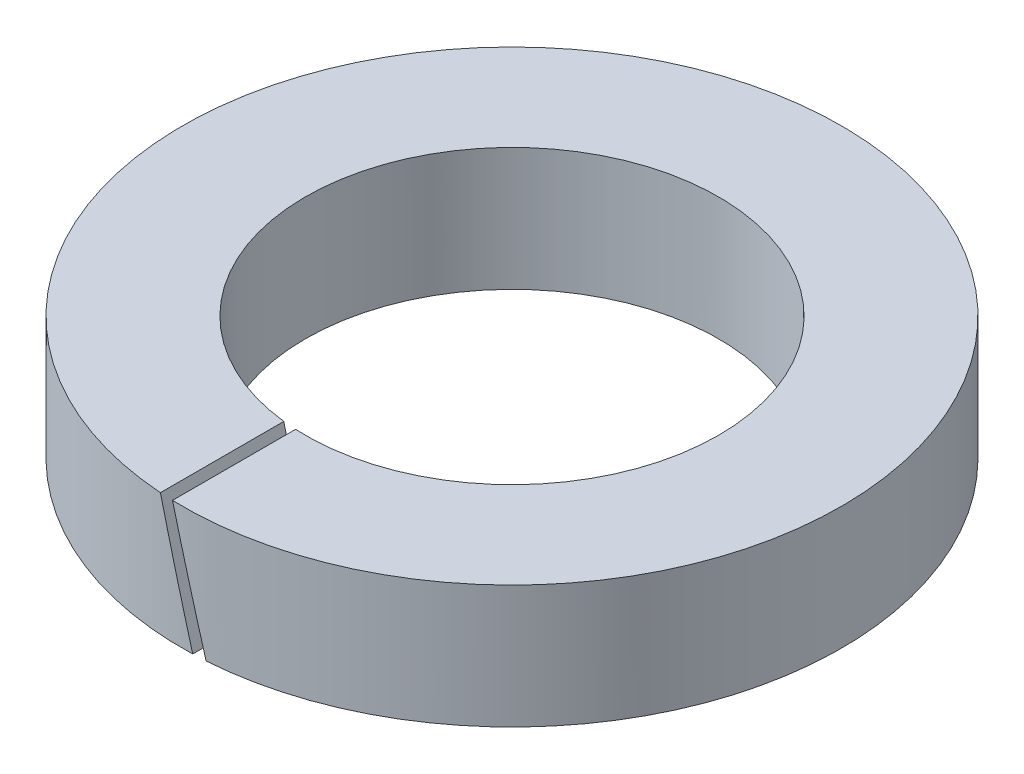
from build123d import *

# Parameters (mm, degrees)
ESQUISSE1_W      = 2.5
ESQUISSE1_H      = 2.5
FENTE_REACH      = 17.189
FENTE_END_RADIUS = 4.2


with BuildPart() as part:
    # Esquisse1 → Base (revolve)
    with BuildSketch(Plane.XY, mode=Mode.PRIVATE) as base_sk:
        with Locations((5.45, 1.25)):
            Rectangle(ESQUISSE1_W, ESQUISSE1_H)
    revolve(base_sk.sketch.rotate(Axis((0, 0.5, 0), (0, -1, 0)), 90), axis=Axis((0, 0.5, 0), (0, -1, 0)))

    # Fente: up to this cylinder (the profile starts outside it)
    fente_end = Plane(origin=(0, 1.25, 0), z_dir=(0, 1, 0)) * Cylinder(FENTE_END_RADIUS, 43.778, mode=Mode.PRIVATE)
    # Esquisse2 → Fente (cut, up to the surface)
    with BuildSketch(Plane.XY.offset(6.7), mode=Mode.PRIVATE) as fente_sk1:
        Polygon((-0.790613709, 3.717647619), (-0.120740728, 1.217647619), (0.549132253, -1.282352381), (0.790613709, -1.217647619), (0.120740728, 1.282352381), (-0.549132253, 3.782352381), align=None)
    fente_tool1 = extrude(fente_sk1.sketch, amount=-FENTE_REACH, mode=Mode.PRIVATE) - fente_end
    add(fente_tool1.solids().sort_by_distance((0, 1.25, 6.7))[0], mode=Mode.SUBTRACT)


solid = part.part
